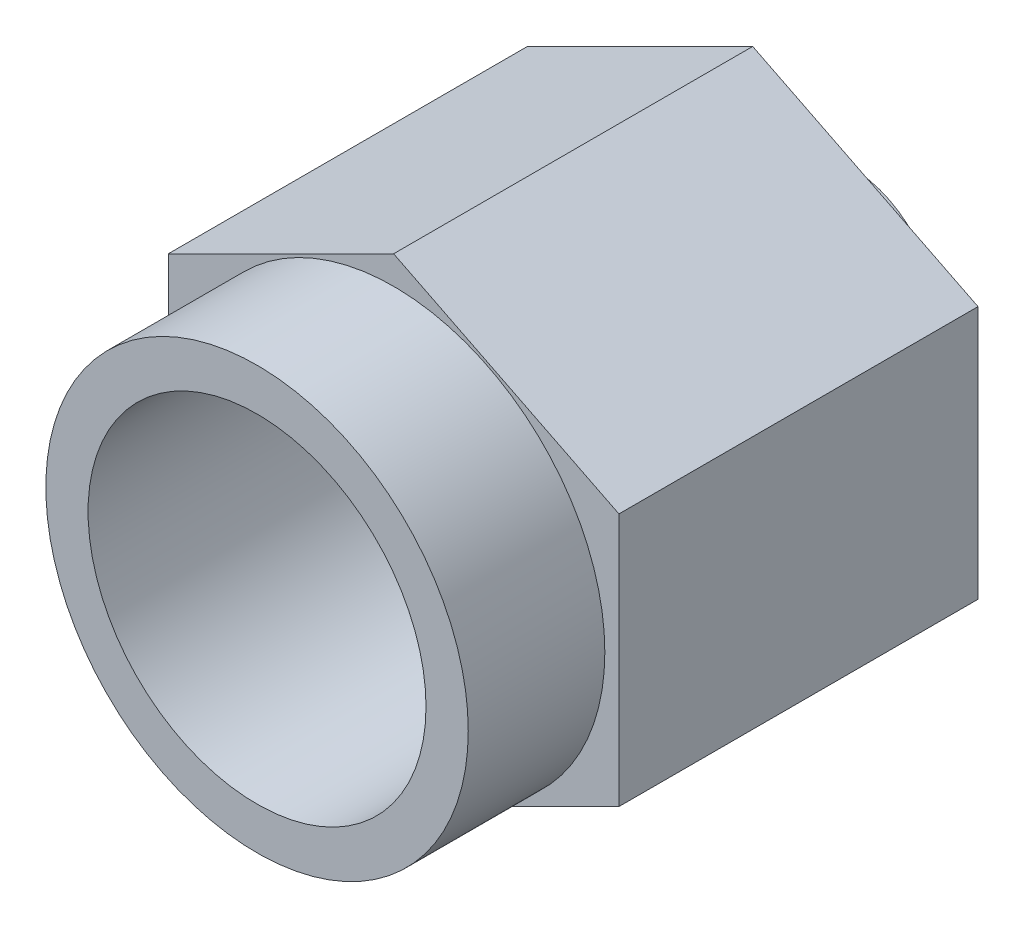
ISO-10303-21;
HEADER;
FILE_DESCRIPTION(('STEP AP214'),'2;1');
FILE_NAME('part.step','',(''),(''),'','','');
FILE_SCHEMA(('AUTOMOTIVE_DESIGN { 1 0 10303 214 1 1 1 1 }'));
ENDSEC;
DATA;
#1=APPLICATION_CONTEXT('core data for automotive mechanical design processes');
#2=APPLICATION_PROTOCOL_DEFINITION('international standard','automotive_design',2000,#1);
#3=PRODUCT_CONTEXT('',#1,'mechanical');
#4=PRODUCT('Part','Part','',(#3));
#5=PRODUCT_RELATED_PRODUCT_CATEGORY('part','',(#4));
#6=PRODUCT_DEFINITION_FORMATION('','',#4);
#7=PRODUCT_DEFINITION_CONTEXT('part definition',#1,'design');
#8=PRODUCT_DEFINITION('design','',#6,#7);
#9=PRODUCT_DEFINITION_SHAPE('','',#8);
#10=(LENGTH_UNIT() NAMED_UNIT(*) SI_UNIT(.MILLI.,.METRE.));
#11=(NAMED_UNIT(*) PLANE_ANGLE_UNIT() SI_UNIT($,.RADIAN.));
#12=(NAMED_UNIT(*) SI_UNIT($,.STERADIAN.) SOLID_ANGLE_UNIT());
#13=UNCERTAINTY_MEASURE_WITH_UNIT(LENGTH_MEASURE(1.E-05),#10,'distance_accuracy_value','');
#14=(GEOMETRIC_REPRESENTATION_CONTEXT(3) GLOBAL_UNCERTAINTY_ASSIGNED_CONTEXT((#13)) GLOBAL_UNIT_ASSIGNED_CONTEXT((#10,
#11,#12)) REPRESENTATION_CONTEXT('',''));
#15=CARTESIAN_POINT('',(0.,0.,0.));
#16=DIRECTION('',(0.,0.,1.));
#17=DIRECTION('',(1.,0.,0.));
#18=AXIS2_PLACEMENT_3D('',#15,#16,#17);
#19=CARTESIAN_POINT('',(0.,0.,0.));
#20=DIRECTION('',(0.,0.,1.));
#21=DIRECTION('',(1.,0.,0.));
#22=AXIS2_PLACEMENT_3D('',#19,#20,#21);
#23=PLANE('',#22);
#24=DIRECTION('',(-0.894427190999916,-0.447213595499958,0.));
#25=VECTOR('',#24,1.);
#26=CARTESIAN_POINT('',(0.,4.318,0.));
#27=LINE('',#26,#25);
#28=CARTESIAN_POINT('',(0.,4.318,0.));
#29=VERTEX_POINT('',#28);
#30=CARTESIAN_POINT('',(-4.064,2.286,0.));
#31=VERTEX_POINT('',#30);
#32=EDGE_CURVE('E94',#29,#31,#27,.T.);
#33=ORIENTED_EDGE('',*,*,#32,.F.);
#34=DIRECTION('',(0.894427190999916,-0.447213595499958,0.));
#35=VECTOR('',#34,1.);
#36=CARTESIAN_POINT('',(0.,4.318,0.));
#37=LINE('',#36,#35);
#38=CARTESIAN_POINT('',(4.064,2.286,0.));
#39=VERTEX_POINT('',#38);
#40=EDGE_CURVE('E125',#29,#39,#37,.T.);
#41=ORIENTED_EDGE('',*,*,#40,.T.);
#42=DIRECTION('',(0.,-1.,0.));
#43=VECTOR('',#42,1.);
#44=CARTESIAN_POINT('',(4.064,2.286,0.));
#45=LINE('',#44,#43);
#46=CARTESIAN_POINT('',(4.06400000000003,-2.286,0.));
#47=VERTEX_POINT('',#46);
#48=EDGE_CURVE('E122',#39,#47,#45,.T.);
#49=ORIENTED_EDGE('',*,*,#48,.T.);
#50=DIRECTION('',(0.894427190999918,0.447213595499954,0.));
#51=VECTOR('',#50,1.);
#52=CARTESIAN_POINT('',(0.,-4.318,0.));
#53=LINE('',#52,#51);
#54=CARTESIAN_POINT('',(0.,-4.318,0.));
#55=VERTEX_POINT('',#54);
#56=EDGE_CURVE('E119',#55,#47,#53,.T.);
#57=ORIENTED_EDGE('',*,*,#56,.F.);
#58=DIRECTION('',(0.894427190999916,-0.447213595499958,0.));
#59=VECTOR('',#58,1.);
#60=CARTESIAN_POINT('',(-4.064,-2.286,0.));
#61=LINE('',#60,#59);
#62=CARTESIAN_POINT('',(-4.064,-2.286,0.));
#63=VERTEX_POINT('',#62);
#64=EDGE_CURVE('E96',#63,#55,#61,.T.);
#65=ORIENTED_EDGE('',*,*,#64,.F.);
#66=DIRECTION('',(0.,-1.,0.));
#67=VECTOR('',#66,1.);
#68=CARTESIAN_POINT('',(-4.064,2.286,0.));
#69=LINE('',#68,#67);
#70=EDGE_CURVE('E89',#31,#63,#69,.T.);
#71=ORIENTED_EDGE('',*,*,#70,.F.);
#72=EDGE_LOOP('',(#33,#41,#49,#57,#65,#71));
#73=FACE_BOUND('',#72,.T.);
#74=CARTESIAN_POINT('',(0.,0.,0.));
#75=DIRECTION('',(0.,0.,1.));
#76=DIRECTION('',(1.,0.,0.));
#77=AXIS2_PLACEMENT_3D('',#74,#75,#76);
#78=CIRCLE('',#77,3.048);
#79=CARTESIAN_POINT('',(3.048,0.,0.));
#80=VERTEX_POINT('',#79);
#81=EDGE_CURVE('E111',#80,#80,#78,.T.);
#82=ORIENTED_EDGE('',*,*,#81,.T.);
#83=EDGE_LOOP('',(#82));
#84=FACE_BOUND('',#83,.T.);
#85=ADVANCED_FACE('F34',(#73,#84),#23,.F.);
#86=CARTESIAN_POINT('',(0.,0.,8.9408));
#87=DIRECTION('',(0.,0.,1.));
#88=DIRECTION('',(1.,0.,0.));
#89=AXIS2_PLACEMENT_3D('',#86,#87,#88);
#90=PLANE('',#89);
#91=CARTESIAN_POINT('',(0.,0.,8.9408));
#92=DIRECTION('',(0.,0.,1.));
#93=DIRECTION('',(1.,0.,0.));
#94=AXIS2_PLACEMENT_3D('',#91,#92,#93);
#95=CIRCLE('',#94,3.81);
#96=CARTESIAN_POINT('',(3.81,0.,8.9408));
#97=VERTEX_POINT('',#96);
#98=EDGE_CURVE('E42',#97,#97,#95,.T.);
#99=ORIENTED_EDGE('',*,*,#98,.T.);
#100=EDGE_LOOP('',(#99));
#101=FACE_BOUND('',#100,.T.);
#102=CARTESIAN_POINT('',(0.,0.,8.9408));
#103=DIRECTION('',(0.,0.,1.));
#104=DIRECTION('',(1.,0.,0.));
#105=AXIS2_PLACEMENT_3D('',#102,#103,#104);
#106=CIRCLE('',#105,3.048);
#107=CARTESIAN_POINT('',(3.048,0.,8.9408));
#108=VERTEX_POINT('',#107);
#109=EDGE_CURVE('E148',#108,#108,#106,.T.);
#110=ORIENTED_EDGE('',*,*,#109,.F.);
#111=EDGE_LOOP('',(#110));
#112=FACE_BOUND('',#111,.T.);
#113=ADVANCED_FACE('F153',(#101,#112),#90,.T.);
#114=CARTESIAN_POINT('',(0.,0.,8.9408));
#115=DIRECTION('',(0.,0.,-1.));
#116=DIRECTION('',(-1.,0.,0.));
#117=AXIS2_PLACEMENT_3D('',#114,#115,#116);
#118=CYLINDRICAL_SURFACE('',#117,3.81);
#119=CARTESIAN_POINT('',(0.,0.,6.477));
#120=DIRECTION('',(0.,0.,1.));
#121=DIRECTION('',(1.,0.,0.));
#122=AXIS2_PLACEMENT_3D('',#119,#120,#121);
#123=CIRCLE('',#122,3.81);
#124=CARTESIAN_POINT('',(3.81,0.,6.477));
#125=VERTEX_POINT('',#124);
#126=EDGE_CURVE('E107',#125,#125,#123,.T.);
#127=ORIENTED_EDGE('',*,*,#126,.T.);
#128=EDGE_LOOP('',(#127));
#129=FACE_BOUND('',#128,.T.);
#130=ORIENTED_EDGE('',*,*,#98,.F.);
#131=EDGE_LOOP('',(#130));
#132=FACE_BOUND('',#131,.T.);
#133=ADVANCED_FACE('F36',(#129,#132),#118,.T.);
#134=CARTESIAN_POINT('',(0.,0.,8.9408));
#135=DIRECTION('',(0.,0.,-1.));
#136=DIRECTION('',(-1.,0.,0.));
#137=AXIS2_PLACEMENT_3D('',#134,#135,#136);
#138=CYLINDRICAL_SURFACE('',#137,3.048);
#139=CARTESIAN_POINT('',(0.,0.,0.254));
#140=DIRECTION('',(0.,0.,1.));
#141=DIRECTION('',(1.,0.,0.));
#142=AXIS2_PLACEMENT_3D('',#139,#140,#141);
#143=CIRCLE('',#142,3.048);
#144=CARTESIAN_POINT('',(3.048,0.,0.254));
#145=VERTEX_POINT('',#144);
#146=EDGE_CURVE('E11',#145,#145,#143,.T.);
#147=ORIENTED_EDGE('',*,*,#146,.F.);
#148=EDGE_LOOP('',(#147));
#149=FACE_BOUND('',#148,.T.);
#150=ORIENTED_EDGE('',*,*,#109,.T.);
#151=EDGE_LOOP('',(#150));
#152=FACE_BOUND('',#151,.T.);
#153=ADVANCED_FACE('F157',(#149,#152),#138,.F.);
#154=CARTESIAN_POINT('',(4.06399999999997,6.34999999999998,6.477));
#155=DIRECTION('',(0.,0.,1.));
#156=DIRECTION('',(1.,0.,0.));
#157=AXIS2_PLACEMENT_3D('',#154,#155,#156);
#158=PLANE('',#157);
#159=DIRECTION('',(-0.894427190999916,-0.447213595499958,0.));
#160=VECTOR('',#159,1.);
#161=CARTESIAN_POINT('',(0.,4.318,6.477));
#162=LINE('',#161,#160);
#163=CARTESIAN_POINT('',(0.,4.318,6.477));
#164=VERTEX_POINT('',#163);
#165=CARTESIAN_POINT('',(-4.064,2.286,6.477));
#166=VERTEX_POINT('',#165);
#167=EDGE_CURVE('E127',#164,#166,#162,.T.);
#168=ORIENTED_EDGE('',*,*,#167,.T.);
#169=DIRECTION('',(0.,-1.,0.));
#170=VECTOR('',#169,1.);
#171=CARTESIAN_POINT('',(-4.064,2.286,6.477));
#172=LINE('',#171,#170);
#173=CARTESIAN_POINT('',(-4.064,-2.286,6.477));
#174=VERTEX_POINT('',#173);
#175=EDGE_CURVE('E104',#166,#174,#172,.T.);
#176=ORIENTED_EDGE('',*,*,#175,.T.);
#177=DIRECTION('',(0.894427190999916,-0.447213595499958,0.));
#178=VECTOR('',#177,1.);
#179=CARTESIAN_POINT('',(-4.064,-2.286,6.477));
#180=LINE('',#179,#178);
#181=CARTESIAN_POINT('',(0.,-4.318,6.477));
#182=VERTEX_POINT('',#181);
#183=EDGE_CURVE('E130',#174,#182,#180,.T.);
#184=ORIENTED_EDGE('',*,*,#183,.T.);
#185=DIRECTION('',(0.894427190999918,0.447213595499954,0.));
#186=VECTOR('',#185,1.);
#187=CARTESIAN_POINT('',(0.,-4.318,6.477));
#188=LINE('',#187,#186);
#189=CARTESIAN_POINT('',(4.06400000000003,-2.286,6.477));
#190=VERTEX_POINT('',#189);
#191=EDGE_CURVE('E132',#182,#190,#188,.T.);
#192=ORIENTED_EDGE('',*,*,#191,.T.);
#193=DIRECTION('',(0.,-1.,0.));
#194=VECTOR('',#193,1.);
#195=CARTESIAN_POINT('',(4.064,2.286,6.477));
#196=LINE('',#195,#194);
#197=CARTESIAN_POINT('',(4.064,2.286,6.477));
#198=VERTEX_POINT('',#197);
#199=EDGE_CURVE('E134',#198,#190,#196,.T.);
#200=ORIENTED_EDGE('',*,*,#199,.F.);
#201=DIRECTION('',(0.894427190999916,-0.447213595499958,0.));
#202=VECTOR('',#201,1.);
#203=CARTESIAN_POINT('',(0.,4.318,6.477));
#204=LINE('',#203,#202);
#205=EDGE_CURVE('E136',#164,#198,#204,.T.);
#206=ORIENTED_EDGE('',*,*,#205,.F.);
#207=EDGE_LOOP('',(#168,#176,#184,#192,#200,#206));
#208=FACE_BOUND('',#207,.T.);
#209=ORIENTED_EDGE('',*,*,#126,.F.);
#210=EDGE_LOOP('',(#209));
#211=FACE_BOUND('',#210,.T.);
#212=ADVANCED_FACE('F163',(#208,#211),#158,.T.);
#213=CARTESIAN_POINT('',(0.,4.318,6.477));
#214=DIRECTION('',(0.447213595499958,-0.894427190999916,0.));
#215=DIRECTION('',(0.894427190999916,0.447213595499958,0.));
#216=AXIS2_PLACEMENT_3D('',#213,#214,#215);
#217=PLANE('',#216);
#218=ORIENTED_EDGE('',*,*,#32,.T.);
#219=DIRECTION('',(0.,0.,-1.));
#220=VECTOR('',#219,1.);
#221=CARTESIAN_POINT('',(-4.064,2.286,6.477));
#222=LINE('',#221,#220);
#223=EDGE_CURVE('E102',#166,#31,#222,.T.);
#224=ORIENTED_EDGE('',*,*,#223,.F.);
#225=ORIENTED_EDGE('',*,*,#167,.F.);
#226=DIRECTION('',(0.,0.,-1.));
#227=VECTOR('',#226,1.);
#228=CARTESIAN_POINT('',(0.,4.318,6.477));
#229=LINE('',#228,#227);
#230=EDGE_CURVE('E49',#164,#29,#229,.T.);
#231=ORIENTED_EDGE('',*,*,#230,.T.);
#232=EDGE_LOOP('',(#218,#224,#225,#231));
#233=FACE_BOUND('',#232,.T.);
#234=ADVANCED_FACE('F110',(#233),#217,.F.);
#235=CARTESIAN_POINT('',(-4.064,2.286,6.477));
#236=DIRECTION('',(1.,0.,0.));
#237=DIRECTION('',(0.,0.,-1.));
#238=AXIS2_PLACEMENT_3D('',#235,#236,#237);
#239=PLANE('',#238);
#240=ORIENTED_EDGE('',*,*,#70,.T.);
#241=DIRECTION('',(0.,0.,-1.));
#242=VECTOR('',#241,1.);
#243=CARTESIAN_POINT('',(-4.064,-2.286,6.477));
#244=LINE('',#243,#242);
#245=EDGE_CURVE('E108',#174,#63,#244,.T.);
#246=ORIENTED_EDGE('',*,*,#245,.F.);
#247=ORIENTED_EDGE('',*,*,#175,.F.);
#248=ORIENTED_EDGE('',*,*,#223,.T.);
#249=EDGE_LOOP('',(#240,#246,#247,#248));
#250=FACE_BOUND('',#249,.T.);
#251=ADVANCED_FACE('F103',(#250),#239,.F.);
#252=CARTESIAN_POINT('',(-4.064,-2.286,6.477));
#253=DIRECTION('',(0.447213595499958,0.894427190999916,0.));
#254=DIRECTION('',(-0.894427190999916,0.447213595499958,0.));
#255=AXIS2_PLACEMENT_3D('',#252,#253,#254);
#256=PLANE('',#255);
#257=ORIENTED_EDGE('',*,*,#64,.T.);
#258=DIRECTION('',(0.,0.,-1.));
#259=VECTOR('',#258,1.);
#260=CARTESIAN_POINT('',(0.,-4.318,6.477));
#261=LINE('',#260,#259);
#262=EDGE_CURVE('E142',#182,#55,#261,.T.);
#263=ORIENTED_EDGE('',*,*,#262,.F.);
#264=ORIENTED_EDGE('',*,*,#183,.F.);
#265=ORIENTED_EDGE('',*,*,#245,.T.);
#266=EDGE_LOOP('',(#257,#263,#264,#265));
#267=FACE_BOUND('',#266,.T.);
#268=ADVANCED_FACE('F175',(#267),#256,.F.);
#269=CARTESIAN_POINT('',(0.,-4.318,6.477));
#270=DIRECTION('',(-0.447213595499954,0.894427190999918,0.));
#271=DIRECTION('',(-0.894427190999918,-0.447213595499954,0.));
#272=AXIS2_PLACEMENT_3D('',#269,#270,#271);
#273=PLANE('',#272);
#274=ORIENTED_EDGE('',*,*,#56,.T.);
#275=DIRECTION('',(0.,0.,-1.));
#276=VECTOR('',#275,1.);
#277=CARTESIAN_POINT('',(4.06400000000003,-2.286,6.477));
#278=LINE('',#277,#276);
#279=EDGE_CURVE('E140',#190,#47,#278,.T.);
#280=ORIENTED_EDGE('',*,*,#279,.F.);
#281=ORIENTED_EDGE('',*,*,#191,.F.);
#282=ORIENTED_EDGE('',*,*,#262,.T.);
#283=EDGE_LOOP('',(#274,#280,#281,#282));
#284=FACE_BOUND('',#283,.T.);
#285=ADVANCED_FACE('F178',(#284),#273,.F.);
#286=CARTESIAN_POINT('',(4.064,2.286,6.477));
#287=DIRECTION('',(1.,0.,0.));
#288=DIRECTION('',(0.,1.,0.));
#289=AXIS2_PLACEMENT_3D('',#286,#287,#288);
#290=PLANE('',#289);
#291=ORIENTED_EDGE('',*,*,#48,.F.);
#292=DIRECTION('',(0.,0.,-1.));
#293=VECTOR('',#292,1.);
#294=CARTESIAN_POINT('',(4.064,2.286,6.477));
#295=LINE('',#294,#293);
#296=EDGE_CURVE('E57',#198,#39,#295,.T.);
#297=ORIENTED_EDGE('',*,*,#296,.F.);
#298=ORIENTED_EDGE('',*,*,#199,.T.);
#299=ORIENTED_EDGE('',*,*,#279,.T.);
#300=EDGE_LOOP('',(#291,#297,#298,#299));
#301=FACE_BOUND('',#300,.T.);
#302=ADVANCED_FACE('F182',(#301),#290,.T.);
#303=CARTESIAN_POINT('',(0.,4.318,6.477));
#304=DIRECTION('',(0.447213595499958,0.894427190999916,0.));
#305=DIRECTION('',(-0.894427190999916,0.447213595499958,0.));
#306=AXIS2_PLACEMENT_3D('',#303,#304,#305);
#307=PLANE('',#306);
#308=ORIENTED_EDGE('',*,*,#40,.F.);
#309=ORIENTED_EDGE('',*,*,#230,.F.);
#310=ORIENTED_EDGE('',*,*,#205,.T.);
#311=ORIENTED_EDGE('',*,*,#296,.T.);
#312=EDGE_LOOP('',(#308,#309,#310,#311));
#313=FACE_BOUND('',#312,.T.);
#314=ADVANCED_FACE('F186',(#313),#307,.T.);
#315=CARTESIAN_POINT('',(0.,0.,-0.508));
#316=DIRECTION('',(0.,0.,1.));
#317=DIRECTION('',(1.,0.,0.));
#318=AXIS2_PLACEMENT_3D('',#315,#316,#317);
#319=CYLINDRICAL_SURFACE('',#318,3.048);
#320=CARTESIAN_POINT('',(0.,0.,-0.508));
#321=DIRECTION('',(0.,0.,1.));
#322=DIRECTION('',(1.,0.,0.));
#323=AXIS2_PLACEMENT_3D('',#320,#321,#322);
#324=CIRCLE('',#323,3.048);
#325=CARTESIAN_POINT('',(3.048,0.,-0.508));
#326=VERTEX_POINT('',#325);
#327=EDGE_CURVE('E114',#326,#326,#324,.T.);
#328=ORIENTED_EDGE('',*,*,#327,.T.);
#329=EDGE_LOOP('',(#328));
#330=FACE_BOUND('',#329,.T.);
#331=ORIENTED_EDGE('',*,*,#81,.F.);
#332=EDGE_LOOP('',(#331));
#333=FACE_BOUND('',#332,.T.);
#334=ADVANCED_FACE('F189',(#330,#333),#319,.T.);
#335=CARTESIAN_POINT('',(0.,0.,-0.508));
#336=DIRECTION('',(0.,0.,1.));
#337=DIRECTION('',(1.,0.,0.));
#338=AXIS2_PLACEMENT_3D('',#335,#336,#337);
#339=PLANE('',#338);
#340=CARTESIAN_POINT('',(0.,0.,-0.508));
#341=DIRECTION('',(0.,0.,1.));
#342=DIRECTION('',(1.,0.,0.));
#343=AXIS2_PLACEMENT_3D('',#340,#341,#342);
#344=CIRCLE('',#343,1.5367);
#345=CARTESIAN_POINT('',(1.5367,0.,-0.508));
#346=VERTEX_POINT('',#345);
#347=EDGE_CURVE('E239',#346,#346,#344,.F.);
#348=ORIENTED_EDGE('',*,*,#347,.F.);
#349=EDGE_LOOP('',(#348));
#350=FACE_BOUND('',#349,.T.);
#351=ORIENTED_EDGE('',*,*,#327,.F.);
#352=EDGE_LOOP('',(#351));
#353=FACE_BOUND('',#352,.T.);
#354=ADVANCED_FACE('F195',(#350,#353),#339,.F.);
#355=CARTESIAN_POINT('',(0.,0.,0.254));
#356=DIRECTION('',(0.,0.,1.));
#357=DIRECTION('',(1.,0.,0.));
#358=AXIS2_PLACEMENT_3D('',#355,#356,#357);
#359=PLANE('',#358);
#360=CARTESIAN_POINT('',(0.,0.,0.254));
#361=DIRECTION('',(0.,0.,1.));
#362=DIRECTION('',(1.,0.,0.));
#363=AXIS2_PLACEMENT_3D('',#360,#361,#362);
#364=CIRCLE('',#363,1.5367);
#365=CARTESIAN_POINT('',(1.5367,0.,0.254));
#366=VERTEX_POINT('',#365);
#367=EDGE_CURVE('E242',#366,#366,#364,.T.);
#368=ORIENTED_EDGE('',*,*,#367,.F.);
#369=EDGE_LOOP('',(#368));
#370=FACE_BOUND('',#369,.T.);
#371=ORIENTED_EDGE('',*,*,#146,.T.);
#372=EDGE_LOOP('',(#371));
#373=FACE_BOUND('',#372,.T.);
#374=ADVANCED_FACE('F199',(#370,#373),#359,.T.);
#375=CARTESIAN_POINT('',(0.,0.,1.778));
#376=DIRECTION('',(0.,0.,-1.));
#377=DIRECTION('',(-1.,0.,0.));
#378=AXIS2_PLACEMENT_3D('',#375,#376,#377);
#379=CYLINDRICAL_SURFACE('',#378,1.5367);
#380=CARTESIAN_POINT('',(0.,0.,-1.778));
#381=DIRECTION('',(0.,0.,1.));
#382=DIRECTION('',(1.,0.,0.));
#383=AXIS2_PLACEMENT_3D('',#380,#381,#382);
#384=CIRCLE('',#383,1.5367);
#385=CARTESIAN_POINT('',(1.5367,0.,-1.778));
#386=VERTEX_POINT('',#385);
#387=EDGE_CURVE('E231',#386,#386,#384,.T.);
#388=ORIENTED_EDGE('',*,*,#387,.T.);
#389=EDGE_LOOP('',(#388));
#390=FACE_BOUND('',#389,.T.);
#391=ORIENTED_EDGE('',*,*,#347,.T.);
#392=EDGE_LOOP('',(#391));
#393=FACE_BOUND('',#392,.T.);
#394=ADVANCED_FACE('F203',(#390,#393),#379,.T.);
#395=CARTESIAN_POINT('',(0.,0.,1.778));
#396=DIRECTION('',(0.,0.,1.));
#397=DIRECTION('',(1.,0.,0.));
#398=AXIS2_PLACEMENT_3D('',#395,#396,#397);
#399=PLANE('',#398);
#400=CARTESIAN_POINT('',(0.,0.,1.778));
#401=DIRECTION('',(0.,0.,1.));
#402=DIRECTION('',(1.,0.,0.));
#403=AXIS2_PLACEMENT_3D('',#400,#401,#402);
#404=CIRCLE('',#403,1.5367);
#405=CARTESIAN_POINT('',(1.5367,0.,1.778));
#406=VERTEX_POINT('',#405);
#407=EDGE_CURVE('E236',#406,#406,#404,.T.);
#408=ORIENTED_EDGE('',*,*,#407,.T.);
#409=EDGE_LOOP('',(#408));
#410=FACE_BOUND('',#409,.T.);
#411=CARTESIAN_POINT('',(0.,0.,1.778));
#412=DIRECTION('',(0.,0.,1.));
#413=DIRECTION('',(1.,0.,0.));
#414=AXIS2_PLACEMENT_3D('',#411,#412,#413);
#415=CIRCLE('',#414,1.0795);
#416=CARTESIAN_POINT('',(1.0795,0.,1.778));
#417=VERTEX_POINT('',#416);
#418=EDGE_CURVE('E225',#417,#417,#415,.T.);
#419=ORIENTED_EDGE('',*,*,#418,.F.);
#420=EDGE_LOOP('',(#419));
#421=FACE_BOUND('',#420,.T.);
#422=ADVANCED_FACE('F211',(#410,#421),#399,.T.);
#423=CARTESIAN_POINT('',(0.,0.,-1.778));
#424=DIRECTION('',(0.,0.,1.));
#425=DIRECTION('',(1.,0.,0.));
#426=AXIS2_PLACEMENT_3D('',#423,#424,#425);
#427=PLANE('',#426);
#428=ORIENTED_EDGE('',*,*,#387,.F.);
#429=EDGE_LOOP('',(#428));
#430=FACE_BOUND('',#429,.T.);
#431=CARTESIAN_POINT('',(0.,0.,-1.778));
#432=DIRECTION('',(0.,0.,1.));
#433=DIRECTION('',(1.,0.,0.));
#434=AXIS2_PLACEMENT_3D('',#431,#432,#433);
#435=CIRCLE('',#434,1.0795);
#436=CARTESIAN_POINT('',(1.0795,0.,-1.778));
#437=VERTEX_POINT('',#436);
#438=EDGE_CURVE('E228',#437,#437,#435,.T.);
#439=ORIENTED_EDGE('',*,*,#438,.T.);
#440=EDGE_LOOP('',(#439));
#441=FACE_BOUND('',#440,.T.);
#442=ADVANCED_FACE('F209',(#430,#441),#427,.F.);
#443=ORIENTED_EDGE('',*,*,#367,.T.);
#444=EDGE_LOOP('',(#443));
#445=FACE_BOUND('',#444,.T.);
#446=ORIENTED_EDGE('',*,*,#407,.F.);
#447=EDGE_LOOP('',(#446));
#448=FACE_BOUND('',#447,.T.);
#449=ADVANCED_FACE('F205',(#445,#448),#379,.T.);
#450=CARTESIAN_POINT('',(0.,0.,1.778));
#451=DIRECTION('',(0.,0.,-1.));
#452=DIRECTION('',(-1.,0.,0.));
#453=AXIS2_PLACEMENT_3D('',#450,#451,#452);
#454=CYLINDRICAL_SURFACE('',#453,1.0795);
#455=ORIENTED_EDGE('',*,*,#418,.T.);
#456=EDGE_LOOP('',(#455));
#457=FACE_BOUND('',#456,.T.);
#458=ORIENTED_EDGE('',*,*,#438,.F.);
#459=EDGE_LOOP('',(#458));
#460=FACE_BOUND('',#459,.T.);
#461=ADVANCED_FACE('F208',(#457,#460),#454,.F.);
#462=CLOSED_SHELL('',(#85,#113,#133,#153,#212,#234,#251,#268,#285,#302,#314,#334,#354,#374,#394,
#422,#442,#449,#461));
#463=MANIFOLD_SOLID_BREP('B2',#462);
#464=ADVANCED_BREP_SHAPE_REPRESENTATION('',(#18,#463),#14);
#465=SHAPE_DEFINITION_REPRESENTATION(#9,#464);
ENDSEC;
END-ISO-10303-21;
